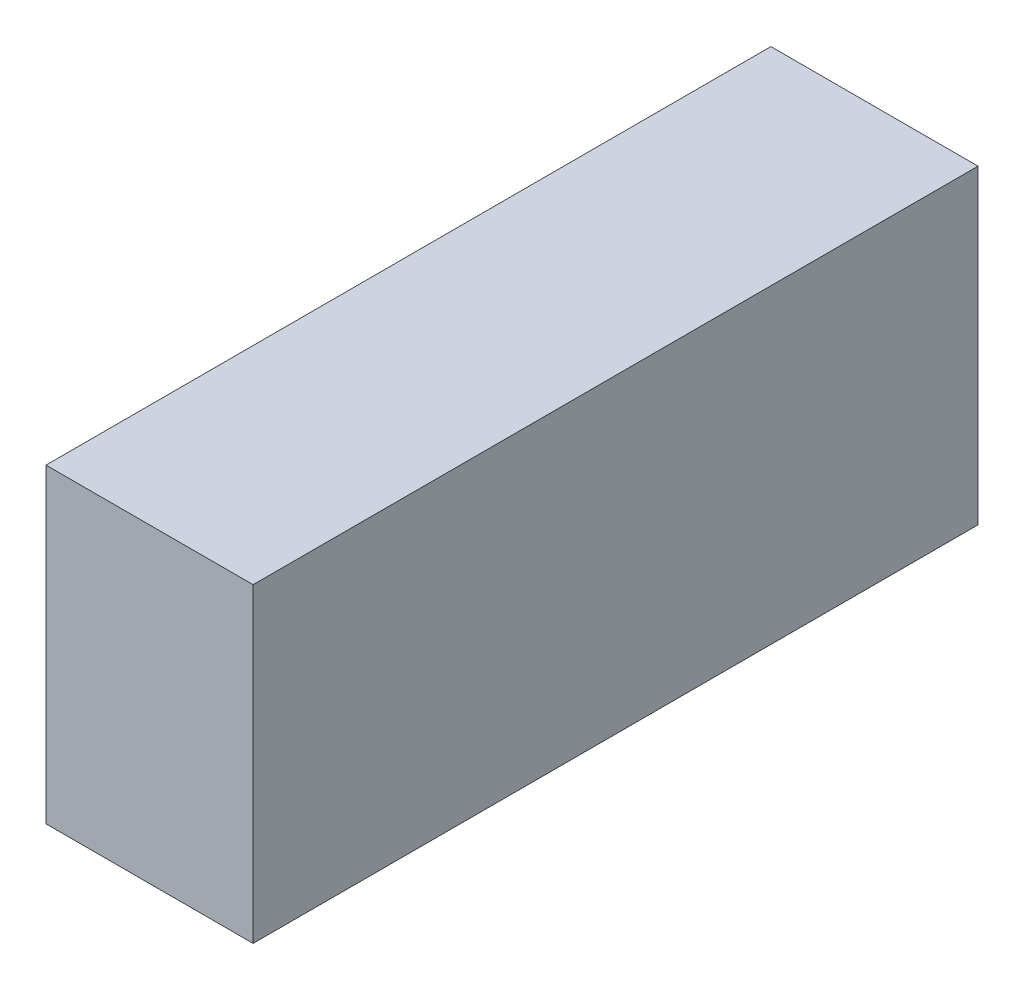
ISO-10303-21;
HEADER;
FILE_DESCRIPTION(('STEP AP214'),'2;1');
FILE_NAME('part.step','',(''),(''),'','','');
FILE_SCHEMA(('AUTOMOTIVE_DESIGN { 1 0 10303 214 1 1 1 1 }'));
ENDSEC;
DATA;
#1=APPLICATION_CONTEXT('core data for automotive mechanical design processes');
#2=APPLICATION_PROTOCOL_DEFINITION('international standard','automotive_design',2000,#1);
#3=PRODUCT_CONTEXT('',#1,'mechanical');
#4=PRODUCT('Part','Part','',(#3));
#5=PRODUCT_RELATED_PRODUCT_CATEGORY('part','',(#4));
#6=PRODUCT_DEFINITION_FORMATION('','',#4);
#7=PRODUCT_DEFINITION_CONTEXT('part definition',#1,'design');
#8=PRODUCT_DEFINITION('design','',#6,#7);
#9=PRODUCT_DEFINITION_SHAPE('','',#8);
#10=(LENGTH_UNIT() NAMED_UNIT(*) SI_UNIT(.MILLI.,.METRE.));
#11=(NAMED_UNIT(*) PLANE_ANGLE_UNIT() SI_UNIT($,.RADIAN.));
#12=(NAMED_UNIT(*) SI_UNIT($,.STERADIAN.) SOLID_ANGLE_UNIT());
#13=UNCERTAINTY_MEASURE_WITH_UNIT(LENGTH_MEASURE(1.E-05),#10,'distance_accuracy_value','');
#14=(GEOMETRIC_REPRESENTATION_CONTEXT(3) GLOBAL_UNCERTAINTY_ASSIGNED_CONTEXT((#13)) GLOBAL_UNIT_ASSIGNED_CONTEXT((#10,
#11,#12)) REPRESENTATION_CONTEXT('',''));
#15=CARTESIAN_POINT('',(0.,0.,0.));
#16=DIRECTION('',(0.,0.,1.));
#17=DIRECTION('',(1.,0.,0.));
#18=AXIS2_PLACEMENT_3D('',#15,#16,#17);
#19=CARTESIAN_POINT('',(-10.,0.,70.));
#20=DIRECTION('',(1.,0.,0.));
#21=DIRECTION('',(0.,0.,-1.));
#22=AXIS2_PLACEMENT_3D('',#19,#20,#21);
#23=PLANE('',#22);
#24=DIRECTION('',(0.,-1.,0.));
#25=VECTOR('',#24,1.);
#26=CARTESIAN_POINT('',(-10.,0.,0.));
#27=LINE('',#26,#25);
#28=CARTESIAN_POINT('',(-10.,30.,0.));
#29=VERTEX_POINT('',#28);
#30=CARTESIAN_POINT('',(-10.,0.,0.));
#31=VERTEX_POINT('',#30);
#32=EDGE_CURVE('E98',#29,#31,#27,.T.);
#33=ORIENTED_EDGE('',*,*,#32,.T.);
#34=DIRECTION('',(0.,0.,-1.));
#35=VECTOR('',#34,1.);
#36=CARTESIAN_POINT('',(-10.,0.,70.));
#37=LINE('',#36,#35);
#38=CARTESIAN_POINT('',(-10.,0.,70.));
#39=VERTEX_POINT('',#38);
#40=EDGE_CURVE('E11',#39,#31,#37,.T.);
#41=ORIENTED_EDGE('',*,*,#40,.F.);
#42=DIRECTION('',(0.,-1.,0.));
#43=VECTOR('',#42,1.);
#44=CARTESIAN_POINT('',(-10.,0.,70.));
#45=LINE('',#44,#43);
#46=CARTESIAN_POINT('',(-10.,30.,70.));
#47=VERTEX_POINT('',#46);
#48=EDGE_CURVE('E86',#47,#39,#45,.T.);
#49=ORIENTED_EDGE('',*,*,#48,.F.);
#50=DIRECTION('',(0.,0.,-1.));
#51=VECTOR('',#50,1.);
#52=CARTESIAN_POINT('',(-10.,30.,70.));
#53=LINE('',#52,#51);
#54=EDGE_CURVE('E94',#47,#29,#53,.T.);
#55=ORIENTED_EDGE('',*,*,#54,.T.);
#56=EDGE_LOOP('',(#33,#41,#49,#55));
#57=FACE_BOUND('',#56,.T.);
#58=ADVANCED_FACE('F35',(#57),#23,.F.);
#59=CARTESIAN_POINT('',(-10.,0.,70.));
#60=DIRECTION('',(0.,1.,0.));
#61=DIRECTION('',(0.,0.,1.));
#62=AXIS2_PLACEMENT_3D('',#59,#60,#61);
#63=PLANE('',#62);
#64=DIRECTION('',(1.,0.,0.));
#65=VECTOR('',#64,1.);
#66=CARTESIAN_POINT('',(-10.,0.,0.));
#67=LINE('',#66,#65);
#68=CARTESIAN_POINT('',(10.,0.,0.));
#69=VERTEX_POINT('',#68);
#70=EDGE_CURVE('E90',#31,#69,#67,.T.);
#71=ORIENTED_EDGE('',*,*,#70,.T.);
#72=DIRECTION('',(0.,0.,-1.));
#73=VECTOR('',#72,1.);
#74=CARTESIAN_POINT('',(10.,0.,70.));
#75=LINE('',#74,#73);
#76=CARTESIAN_POINT('',(10.,0.,70.));
#77=VERTEX_POINT('',#76);
#78=EDGE_CURVE('E43',#77,#69,#75,.T.);
#79=ORIENTED_EDGE('',*,*,#78,.F.);
#80=DIRECTION('',(1.,0.,0.));
#81=VECTOR('',#80,1.);
#82=CARTESIAN_POINT('',(-10.,0.,70.));
#83=LINE('',#82,#81);
#84=EDGE_CURVE('E81',#39,#77,#83,.T.);
#85=ORIENTED_EDGE('',*,*,#84,.F.);
#86=ORIENTED_EDGE('',*,*,#40,.T.);
#87=EDGE_LOOP('',(#71,#79,#85,#86));
#88=FACE_BOUND('',#87,.T.);
#89=ADVANCED_FACE('F89',(#88),#63,.F.);
#90=CARTESIAN_POINT('',(10.,0.,70.));
#91=DIRECTION('',(-1.,0.,0.));
#92=DIRECTION('',(0.,0.,1.));
#93=AXIS2_PLACEMENT_3D('',#90,#91,#92);
#94=PLANE('',#93);
#95=DIRECTION('',(0.,1.,0.));
#96=VECTOR('',#95,1.);
#97=CARTESIAN_POINT('',(10.,0.,0.));
#98=LINE('',#97,#96);
#99=CARTESIAN_POINT('',(10.,30.,0.));
#100=VERTEX_POINT('',#99);
#101=EDGE_CURVE('E68',#69,#100,#98,.T.);
#102=ORIENTED_EDGE('',*,*,#101,.T.);
#103=DIRECTION('',(0.,0.,-1.));
#104=VECTOR('',#103,1.);
#105=CARTESIAN_POINT('',(10.,30.,70.));
#106=LINE('',#105,#104);
#107=CARTESIAN_POINT('',(10.,30.,70.));
#108=VERTEX_POINT('',#107);
#109=EDGE_CURVE('E91',#108,#100,#106,.T.);
#110=ORIENTED_EDGE('',*,*,#109,.F.);
#111=DIRECTION('',(0.,1.,0.));
#112=VECTOR('',#111,1.);
#113=CARTESIAN_POINT('',(10.,0.,70.));
#114=LINE('',#113,#112);
#115=EDGE_CURVE('E84',#77,#108,#114,.T.);
#116=ORIENTED_EDGE('',*,*,#115,.F.);
#117=ORIENTED_EDGE('',*,*,#78,.T.);
#118=EDGE_LOOP('',(#102,#110,#116,#117));
#119=FACE_BOUND('',#118,.T.);
#120=ADVANCED_FACE('F92',(#119),#94,.F.);
#121=CARTESIAN_POINT('',(-10.,30.,70.));
#122=DIRECTION('',(0.,-1.,0.));
#123=DIRECTION('',(0.,0.,-1.));
#124=AXIS2_PLACEMENT_3D('',#121,#122,#123);
#125=PLANE('',#124);
#126=DIRECTION('',(-1.,0.,0.));
#127=VECTOR('',#126,1.);
#128=CARTESIAN_POINT('',(-10.,30.,0.));
#129=LINE('',#128,#127);
#130=EDGE_CURVE('E74',#100,#29,#129,.T.);
#131=ORIENTED_EDGE('',*,*,#130,.T.);
#132=ORIENTED_EDGE('',*,*,#54,.F.);
#133=DIRECTION('',(-1.,0.,0.));
#134=VECTOR('',#133,1.);
#135=CARTESIAN_POINT('',(-10.,30.,70.));
#136=LINE('',#135,#134);
#137=EDGE_CURVE('E51',#108,#47,#136,.T.);
#138=ORIENTED_EDGE('',*,*,#137,.F.);
#139=ORIENTED_EDGE('',*,*,#109,.T.);
#140=EDGE_LOOP('',(#131,#132,#138,#139));
#141=FACE_BOUND('',#140,.T.);
#142=ADVANCED_FACE('F105',(#141),#125,.F.);
#143=CARTESIAN_POINT('',(0.,0.,70.));
#144=DIRECTION('',(0.,0.,-1.));
#145=DIRECTION('',(-1.,0.,0.));
#146=AXIS2_PLACEMENT_3D('',#143,#144,#145);
#147=PLANE('',#146);
#148=ORIENTED_EDGE('',*,*,#48,.T.);
#149=ORIENTED_EDGE('',*,*,#84,.T.);
#150=ORIENTED_EDGE('',*,*,#115,.T.);
#151=ORIENTED_EDGE('',*,*,#137,.T.);
#152=EDGE_LOOP('',(#148,#149,#150,#151));
#153=FACE_BOUND('',#152,.T.);
#154=ADVANCED_FACE('F82',(#153),#147,.F.);
#155=CARTESIAN_POINT('',(0.,0.,0.));
#156=DIRECTION('',(0.,0.,-1.));
#157=DIRECTION('',(-1.,0.,0.));
#158=AXIS2_PLACEMENT_3D('',#155,#156,#157);
#159=PLANE('',#158);
#160=ORIENTED_EDGE('',*,*,#32,.F.);
#161=ORIENTED_EDGE('',*,*,#130,.F.);
#162=ORIENTED_EDGE('',*,*,#101,.F.);
#163=ORIENTED_EDGE('',*,*,#70,.F.);
#164=EDGE_LOOP('',(#160,#161,#162,#163));
#165=FACE_BOUND('',#164,.T.);
#166=ADVANCED_FACE('F108',(#165),#159,.T.);
#167=CLOSED_SHELL('',(#58,#89,#120,#142,#154,#166));
#168=MANIFOLD_SOLID_BREP('B2',#167);
#169=ADVANCED_BREP_SHAPE_REPRESENTATION('',(#18,#168),#14);
#170=SHAPE_DEFINITION_REPRESENTATION(#9,#169);
ENDSEC;
END-ISO-10303-21;
